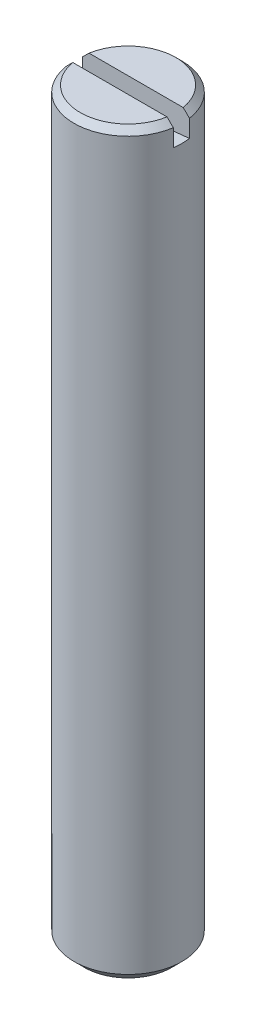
ISO-10303-21;
HEADER;
FILE_DESCRIPTION(('STEP AP214'),'2;1');
FILE_NAME('part.step','',(''),(''),'','','');
FILE_SCHEMA(('AUTOMOTIVE_DESIGN { 1 0 10303 214 1 1 1 1 }'));
ENDSEC;
DATA;
#1=APPLICATION_CONTEXT('core data for automotive mechanical design processes');
#2=APPLICATION_PROTOCOL_DEFINITION('international standard','automotive_design',2000,#1);
#3=PRODUCT_CONTEXT('',#1,'mechanical');
#4=PRODUCT('Part','Part','',(#3));
#5=PRODUCT_RELATED_PRODUCT_CATEGORY('part','',(#4));
#6=PRODUCT_DEFINITION_FORMATION('','',#4);
#7=PRODUCT_DEFINITION_CONTEXT('part definition',#1,'design');
#8=PRODUCT_DEFINITION('design','',#6,#7);
#9=PRODUCT_DEFINITION_SHAPE('','',#8);
#10=(LENGTH_UNIT() NAMED_UNIT(*) SI_UNIT(.MILLI.,.METRE.));
#11=(NAMED_UNIT(*) PLANE_ANGLE_UNIT() SI_UNIT($,.RADIAN.));
#12=(NAMED_UNIT(*) SI_UNIT($,.STERADIAN.) SOLID_ANGLE_UNIT());
#13=UNCERTAINTY_MEASURE_WITH_UNIT(LENGTH_MEASURE(1.E-05),#10,'distance_accuracy_value','');
#14=(GEOMETRIC_REPRESENTATION_CONTEXT(3) GLOBAL_UNCERTAINTY_ASSIGNED_CONTEXT((#13)) GLOBAL_UNIT_ASSIGNED_CONTEXT((#10,
#11,#12)) REPRESENTATION_CONTEXT('',''));
#15=CARTESIAN_POINT('',(0.,0.,0.));
#16=DIRECTION('',(0.,0.,1.));
#17=DIRECTION('',(1.,0.,0.));
#18=AXIS2_PLACEMENT_3D('',#15,#16,#17);
#19=CARTESIAN_POINT('',(0.,50.,0.));
#20=DIRECTION('',(0.,-1.,0.));
#21=DIRECTION('',(0.,0.,-1.));
#22=AXIS2_PLACEMENT_3D('',#19,#20,#21);
#23=PLANE('',#22);
#24=CARTESIAN_POINT('',(0.,50.0000000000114,0.));
#25=DIRECTION('',(0.,-1.,0.));
#26=DIRECTION('',(0.,0.,-1.));
#27=AXIS2_PLACEMENT_3D('',#24,#25,#26);
#28=CIRCLE('',#27,3.53999999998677);
#29=CARTESIAN_POINT('',(-3.48878202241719,50.0000000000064,-0.6));
#30=VERTEX_POINT('',#29);
#31=CARTESIAN_POINT('',(3.48878202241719,50.0000000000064,-0.6));
#32=VERTEX_POINT('',#31);
#33=EDGE_CURVE('E87',#30,#32,#28,.T.);
#34=ORIENTED_EDGE('',*,*,#33,.F.);
#35=DIRECTION('',(1.,0.,0.));
#36=VECTOR('',#35,1.);
#37=CARTESIAN_POINT('',(0.,50.,-0.6));
#38=LINE('',#37,#36);
#39=EDGE_CURVE('E19',#32,#30,#38,.F.);
#40=ORIENTED_EDGE('',*,*,#39,.F.);
#41=EDGE_LOOP('',(#34,#40));
#42=FACE_BOUND('',#41,.T.);
#43=ADVANCED_FACE('F14',(#42),#23,.F.);
#44=CARTESIAN_POINT('',(0.,50.,0.));
#45=DIRECTION('',(0.,-1.,0.));
#46=DIRECTION('',(0.,0.,-1.));
#47=AXIS2_PLACEMENT_3D('',#44,#45,#46);
#48=PLANE('',#47);
#49=DIRECTION('',(1.,0.,0.));
#50=VECTOR('',#49,1.);
#51=CARTESIAN_POINT('',(0.,50.,0.6));
#52=LINE('',#51,#50);
#53=CARTESIAN_POINT('',(-3.48878202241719,50.0000000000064,0.6));
#54=VERTEX_POINT('',#53);
#55=CARTESIAN_POINT('',(3.48878202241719,50.0000000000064,0.6));
#56=VERTEX_POINT('',#55);
#57=EDGE_CURVE('E81',#54,#56,#52,.T.);
#58=ORIENTED_EDGE('',*,*,#57,.F.);
#59=CARTESIAN_POINT('',(0.,50.0000000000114,0.));
#60=DIRECTION('',(0.,-1.,0.));
#61=DIRECTION('',(0.,0.,-1.));
#62=AXIS2_PLACEMENT_3D('',#59,#60,#61);
#63=CIRCLE('',#62,3.53999999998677);
#64=EDGE_CURVE('E74',#56,#54,#63,.T.);
#65=ORIENTED_EDGE('',*,*,#64,.F.);
#66=EDGE_LOOP('',(#58,#65));
#67=FACE_BOUND('',#66,.T.);
#68=ADVANCED_FACE('F86',(#67),#48,.F.);
#69=CARTESIAN_POINT('',(0.,49.5399999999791,0.));
#70=DIRECTION('',(0.,-1.,0.));
#71=DIRECTION('',(0.,0.,-1.));
#72=AXIS2_PLACEMENT_3D('',#69,#70,#71);
#73=CONICAL_SURFACE('',#72,3.99999999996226,0.785398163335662);
#74=CARTESIAN_POINT('',(-3.48878202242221,50.0000000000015,-0.6));
#75=CARTESIAN_POINT('',(-3.56650335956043,49.9233951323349,-0.6));
#76=CARTESIAN_POINT('',(-3.64419419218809,49.8467593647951,-0.6));
#77=CARTESIAN_POINT('',(-3.79951484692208,49.6934260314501,-0.6));
#78=CARTESIAN_POINT('',(-3.87714466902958,49.6167284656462,-0.6));
#79=CARTESIAN_POINT('',(-3.9547439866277,49.5399999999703,-0.6));
#80=B_SPLINE_CURVE_WITH_KNOTS('',3,(#74,#75,#76,#77,#78,#79),.UNSPECIFIED.,.F.,.F.,(4,2,4),(0.,
0.327383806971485,0.654767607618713),.UNSPECIFIED.);
#81=CARTESIAN_POINT('',(-3.95474398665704,49.5399999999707,-0.6));
#82=VERTEX_POINT('',#81);
#83=EDGE_CURVE('E85',#30,#82,#80,.T.);
#84=ORIENTED_EDGE('',*,*,#83,.F.);
#85=ORIENTED_EDGE('',*,*,#33,.T.);
#86=CARTESIAN_POINT('',(3.95474398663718,49.5399999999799,-0.600000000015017));
#87=CARTESIAN_POINT('',(3.87714466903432,49.616728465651,-0.600000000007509));
#88=CARTESIAN_POINT('',(3.79951484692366,49.6934260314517,-0.600000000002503));
#89=CARTESIAN_POINT('',(3.64419419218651,49.8467593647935,-0.599999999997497));
#90=CARTESIAN_POINT('',(3.56650335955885,49.9233951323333,-0.599999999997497));
#91=CARTESIAN_POINT('',(3.48878202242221,50.0000000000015,-0.6));
#92=B_SPLINE_CURVE_WITH_KNOTS('',3,(#86,#87,#88,#89,#90,#91),.UNSPECIFIED.,.F.,.F.,(4,2,4),(0.,
0.327383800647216,0.654767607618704),.UNSPECIFIED.);
#93=CARTESIAN_POINT('',(3.95474398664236,49.5399999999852,-0.6));
#94=VERTEX_POINT('',#93);
#95=EDGE_CURVE('E112',#94,#32,#92,.T.);
#96=ORIENTED_EDGE('',*,*,#95,.F.);
#97=CARTESIAN_POINT('',(0.,49.54,0.));
#98=DIRECTION('',(0.,-1.,0.));
#99=DIRECTION('',(0.,0.,-1.));
#100=AXIS2_PLACEMENT_3D('',#97,#98,#99);
#101=CIRCLE('',#100,4.);
#102=EDGE_CURVE('E101',#82,#94,#101,.T.);
#103=ORIENTED_EDGE('',*,*,#102,.F.);
#104=EDGE_LOOP('',(#84,#85,#96,#103));
#105=FACE_BOUND('',#104,.T.);
#106=ADVANCED_FACE('F128',(#105),#73,.T.);
#107=CARTESIAN_POINT('',(0.,79.5,-0.6));
#108=DIRECTION('',(0.,0.,1.));
#109=DIRECTION('',(1.,0.,0.));
#110=AXIS2_PLACEMENT_3D('',#107,#108,#109);
#111=PLANE('',#110);
#112=ORIENTED_EDGE('',*,*,#39,.T.);
#113=ORIENTED_EDGE('',*,*,#83,.T.);
#114=DIRECTION('',(0.,1.,0.));
#115=VECTOR('',#114,1.);
#116=CARTESIAN_POINT('',(-3.95474398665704,79.5,-0.6));
#117=LINE('',#116,#115);
#118=CARTESIAN_POINT('',(-3.95474398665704,48.2492400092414,-0.6));
#119=VERTEX_POINT('',#118);
#120=EDGE_CURVE('E58',#82,#119,#117,.F.);
#121=ORIENTED_EDGE('',*,*,#120,.T.);
#122=CARTESIAN_POINT('',(0.,79.5,-0.6));
#123=DIRECTION('',(0.,0.,-1.));
#124=DIRECTION('',(-1.,0.,0.));
#125=AXIS2_PLACEMENT_3D('',#122,#123,#124);
#126=CIRCLE('',#125,31.5);
#127=CARTESIAN_POINT('',(3.95474398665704,48.2492400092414,-0.6));
#128=VERTEX_POINT('',#127);
#129=EDGE_CURVE('E109',#119,#128,#126,.F.);
#130=ORIENTED_EDGE('',*,*,#129,.T.);
#131=DIRECTION('',(0.,1.,0.));
#132=VECTOR('',#131,1.);
#133=CARTESIAN_POINT('',(3.95474398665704,79.5,-0.6));
#134=LINE('',#133,#132);
#135=EDGE_CURVE('E110',#128,#94,#134,.T.);
#136=ORIENTED_EDGE('',*,*,#135,.T.);
#137=ORIENTED_EDGE('',*,*,#95,.T.);
#138=EDGE_LOOP('',(#112,#113,#121,#130,#136,#137));
#139=FACE_BOUND('',#138,.T.);
#140=ADVANCED_FACE('F124',(#139),#111,.T.);
#141=CARTESIAN_POINT('',(0.,49.5399999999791,0.));
#142=DIRECTION('',(0.,-1.,0.));
#143=DIRECTION('',(0.,0.,-1.));
#144=AXIS2_PLACEMENT_3D('',#141,#142,#143);
#145=CONICAL_SURFACE('',#144,3.99999999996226,0.785398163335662);
#146=ORIENTED_EDGE('',*,*,#64,.T.);
#147=CARTESIAN_POINT('',(-3.48878202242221,50.0000000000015,0.6));
#148=CARTESIAN_POINT('',(-3.56650335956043,49.9233951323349,0.6));
#149=CARTESIAN_POINT('',(-3.64419419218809,49.8467593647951,0.6));
#150=CARTESIAN_POINT('',(-3.79951484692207,49.6934260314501,0.6));
#151=CARTESIAN_POINT('',(-3.87714466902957,49.6167284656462,0.6));
#152=CARTESIAN_POINT('',(-3.95474398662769,49.5399999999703,0.6));
#153=B_SPLINE_CURVE_WITH_KNOTS('',3,(#147,#148,#149,#150,#151,#152),.UNSPECIFIED.,.F.,.F.,(4,2,
4),(0.,0.327383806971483,0.654767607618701),.UNSPECIFIED.);
#154=CARTESIAN_POINT('',(-3.95474398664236,49.5399999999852,0.6));
#155=VERTEX_POINT('',#154);
#156=EDGE_CURVE('E34',#54,#155,#153,.T.);
#157=ORIENTED_EDGE('',*,*,#156,.T.);
#158=CARTESIAN_POINT('',(0.,49.54,0.));
#159=DIRECTION('',(0.,-1.,0.));
#160=DIRECTION('',(0.,0.,-1.));
#161=AXIS2_PLACEMENT_3D('',#158,#159,#160);
#162=CIRCLE('',#161,4.);
#163=CARTESIAN_POINT('',(3.95474398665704,49.5399999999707,0.6));
#164=VERTEX_POINT('',#163);
#165=EDGE_CURVE('E75',#164,#155,#162,.T.);
#166=ORIENTED_EDGE('',*,*,#165,.F.);
#167=CARTESIAN_POINT('',(3.95474398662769,49.5399999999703,0.6));
#168=CARTESIAN_POINT('',(3.87714466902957,49.6167284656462,0.6));
#169=CARTESIAN_POINT('',(3.79951484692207,49.6934260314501,0.6));
#170=CARTESIAN_POINT('',(3.64419419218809,49.8467593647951,0.6));
#171=CARTESIAN_POINT('',(3.56650335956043,49.9233951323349,0.6));
#172=CARTESIAN_POINT('',(3.48878202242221,50.0000000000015,0.6));
#173=B_SPLINE_CURVE_WITH_KNOTS('',3,(#167,#168,#169,#170,#171,#172),.UNSPECIFIED.,.F.,.F.,(4,2,
4),(0.,0.327383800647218,0.654767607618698),.UNSPECIFIED.);
#174=EDGE_CURVE('E70',#164,#56,#173,.T.);
#175=ORIENTED_EDGE('',*,*,#174,.T.);
#176=EDGE_LOOP('',(#146,#157,#166,#175));
#177=FACE_BOUND('',#176,.T.);
#178=ADVANCED_FACE('F72',(#177),#145,.T.);
#179=CARTESIAN_POINT('',(0.,79.5,0.6));
#180=DIRECTION('',(0.,0.,1.));
#181=DIRECTION('',(1.,0.,0.));
#182=AXIS2_PLACEMENT_3D('',#179,#180,#181);
#183=PLANE('',#182);
#184=ORIENTED_EDGE('',*,*,#57,.T.);
#185=ORIENTED_EDGE('',*,*,#174,.F.);
#186=DIRECTION('',(0.,1.,0.));
#187=VECTOR('',#186,1.);
#188=CARTESIAN_POINT('',(3.95474398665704,79.5,0.6));
#189=LINE('',#188,#187);
#190=CARTESIAN_POINT('',(3.95474398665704,48.2492400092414,0.6));
#191=VERTEX_POINT('',#190);
#192=EDGE_CURVE('E78',#191,#164,#189,.T.);
#193=ORIENTED_EDGE('',*,*,#192,.F.);
#194=CARTESIAN_POINT('',(0.,79.5,0.6));
#195=DIRECTION('',(0.,0.,-1.));
#196=DIRECTION('',(-1.,0.,0.));
#197=AXIS2_PLACEMENT_3D('',#194,#195,#196);
#198=CIRCLE('',#197,31.5);
#199=CARTESIAN_POINT('',(-3.95474398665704,48.2492400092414,0.6));
#200=VERTEX_POINT('',#199);
#201=EDGE_CURVE('E106',#200,#191,#198,.F.);
#202=ORIENTED_EDGE('',*,*,#201,.F.);
#203=DIRECTION('',(0.,1.,0.));
#204=VECTOR('',#203,1.);
#205=CARTESIAN_POINT('',(-3.95474398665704,79.5,0.6));
#206=LINE('',#205,#204);
#207=EDGE_CURVE('E104',#155,#200,#206,.F.);
#208=ORIENTED_EDGE('',*,*,#207,.F.);
#209=ORIENTED_EDGE('',*,*,#156,.F.);
#210=EDGE_LOOP('',(#184,#185,#193,#202,#208,#209));
#211=FACE_BOUND('',#210,.T.);
#212=ADVANCED_FACE('F82',(#211),#183,.F.);
#213=CARTESIAN_POINT('',(0.,79.5,0.6));
#214=DIRECTION('',(0.,0.,-1.));
#215=DIRECTION('',(-1.,0.,0.));
#216=AXIS2_PLACEMENT_3D('',#213,#214,#215);
#217=CYLINDRICAL_SURFACE('',#216,31.5);
#218=CARTESIAN_POINT('',(3.95474398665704,48.2492400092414,-0.6));
#219=CARTESIAN_POINT('',(3.96984984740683,48.2511544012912,-0.500484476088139));
#220=CARTESIAN_POINT('',(3.98118553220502,48.2525972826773,-0.40038868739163));
#221=CARTESIAN_POINT('',(3.9962389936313,48.2545175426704,-0.20019306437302));
#222=CARTESIAN_POINT('',(4.,48.2550004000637,-0.10009653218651));
#223=CARTESIAN_POINT('',(4.,48.2550004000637,0.10009653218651));
#224=CARTESIAN_POINT('',(3.9962389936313,48.2545175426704,0.20019306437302));
#225=CARTESIAN_POINT('',(3.98118553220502,48.2525972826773,0.40038868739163));
#226=CARTESIAN_POINT('',(3.96984984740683,48.2511544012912,0.500484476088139));
#227=CARTESIAN_POINT('',(3.95474398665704,48.2492400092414,0.6));
#228=B_SPLINE_CURVE_WITH_KNOTS('',3,(#218,#219,#220,#221,#222,#223,#224,#225,#226,#227),
.UNSPECIFIED.,.F.,.F.,(4,2,2,2,4),(0.,0.301946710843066,0.602165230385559,0.902383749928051,
1.20433046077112),.UNSPECIFIED.);
#229=EDGE_CURVE('E25',#128,#191,#228,.T.);
#230=ORIENTED_EDGE('',*,*,#229,.F.);
#231=ORIENTED_EDGE('',*,*,#129,.F.);
#232=CARTESIAN_POINT('',(-3.95474398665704,48.2492400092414,0.6));
#233=CARTESIAN_POINT('',(-3.96984984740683,48.2511544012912,0.500484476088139));
#234=CARTESIAN_POINT('',(-3.98118553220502,48.2525972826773,0.40038868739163));
#235=CARTESIAN_POINT('',(-3.9962389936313,48.2545175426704,0.20019306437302));
#236=CARTESIAN_POINT('',(-4.,48.2550004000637,0.10009653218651));
#237=CARTESIAN_POINT('',(-4.,48.2550004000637,-0.10009653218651));
#238=CARTESIAN_POINT('',(-3.9962389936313,48.2545175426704,-0.20019306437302));
#239=CARTESIAN_POINT('',(-3.98118553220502,48.2525972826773,-0.40038868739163));
#240=CARTESIAN_POINT('',(-3.96984984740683,48.2511544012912,-0.500484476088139));
#241=CARTESIAN_POINT('',(-3.95474398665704,48.2492400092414,-0.6));
#242=B_SPLINE_CURVE_WITH_KNOTS('',3,(#232,#233,#234,#235,#236,#237,#238,#239,#240,#241),
.UNSPECIFIED.,.F.,.F.,(4,2,2,2,4),(0.,0.301946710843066,0.602165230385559,0.902383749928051,
1.20433046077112),.UNSPECIFIED.);
#243=EDGE_CURVE('E9',#200,#119,#242,.T.);
#244=ORIENTED_EDGE('',*,*,#243,.F.);
#245=ORIENTED_EDGE('',*,*,#201,.T.);
#246=EDGE_LOOP('',(#230,#231,#244,#245));
#247=FACE_BOUND('',#246,.T.);
#248=ADVANCED_FACE('F151',(#247),#217,.F.);
#249=CARTESIAN_POINT('',(0.,37.5,0.));
#250=DIRECTION('',(0.,-1.,0.));
#251=DIRECTION('',(0.,0.,-1.));
#252=AXIS2_PLACEMENT_3D('',#249,#250,#251);
#253=CYLINDRICAL_SURFACE('',#252,4.);
#254=ORIENTED_EDGE('',*,*,#229,.T.);
#255=ORIENTED_EDGE('',*,*,#192,.T.);
#256=ORIENTED_EDGE('',*,*,#165,.T.);
#257=ORIENTED_EDGE('',*,*,#207,.T.);
#258=ORIENTED_EDGE('',*,*,#243,.T.);
#259=ORIENTED_EDGE('',*,*,#120,.F.);
#260=ORIENTED_EDGE('',*,*,#102,.T.);
#261=ORIENTED_EDGE('',*,*,#135,.F.);
#262=EDGE_LOOP('',(#254,#255,#256,#257,#258,#259,#260,#261));
#263=FACE_BOUND('',#262,.T.);
#264=CARTESIAN_POINT('',(0.,-4.233,0.));
#265=DIRECTION('',(0.,-1.,0.));
#266=DIRECTION('',(0.,0.,-1.));
#267=AXIS2_PLACEMENT_3D('',#264,#265,#266);
#268=CIRCLE('',#267,4.);
#269=CARTESIAN_POINT('',(0.,-4.233,-4.));
#270=VERTEX_POINT('',#269);
#271=EDGE_CURVE('E103',#270,#270,#268,.T.);
#272=ORIENTED_EDGE('',*,*,#271,.F.);
#273=EDGE_LOOP('',(#272));
#274=FACE_BOUND('',#273,.T.);
#275=ADVANCED_FACE('F16',(#263,#274),#253,.T.);
#276=CARTESIAN_POINT('',(3.233,-5.,0.));
#277=DIRECTION('',(0.,1.,0.));
#278=DIRECTION('',(0.,0.,1.));
#279=AXIS2_PLACEMENT_3D('',#276,#277,#278);
#280=PLANE('',#279);
#281=CARTESIAN_POINT('',(0.,-5.,0.));
#282=DIRECTION('',(0.,1.,0.));
#283=DIRECTION('',(-1.,0.,0.));
#284=AXIS2_PLACEMENT_3D('',#281,#282,#283);
#285=CIRCLE('',#284,3.23299999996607);
#286=CARTESIAN_POINT('',(-3.23299999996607,-5.,0.));
#287=VERTEX_POINT('',#286);
#288=EDGE_CURVE('E171',#287,#287,#285,.T.);
#289=ORIENTED_EDGE('',*,*,#288,.F.);
#290=EDGE_LOOP('',(#289));
#291=FACE_BOUND('',#290,.T.);
#292=ADVANCED_FACE('F157',(#291),#280,.F.);
#293=CARTESIAN_POINT('',(0.,-4.23299999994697,0.));
#294=DIRECTION('',(0.,1.,0.));
#295=DIRECTION('',(-1.,0.,0.));
#296=AXIS2_PLACEMENT_3D('',#293,#294,#295);
#297=CONICAL_SURFACE('',#296,4.0000000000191,0.785398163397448);
#298=ORIENTED_EDGE('',*,*,#271,.T.);
#299=EDGE_LOOP('',(#298));
#300=FACE_BOUND('',#299,.T.);
#301=ORIENTED_EDGE('',*,*,#288,.T.);
#302=EDGE_LOOP('',(#301));
#303=FACE_BOUND('',#302,.T.);
#304=ADVANCED_FACE('F177',(#300,#303),#297,.T.);
#305=CLOSED_SHELL('',(#43,#68,#106,#140,#178,#212,#248,#275,#292,#304));
#306=MANIFOLD_SOLID_BREP('B1',#305);
#307=ADVANCED_BREP_SHAPE_REPRESENTATION('',(#18,#306),#14);
#308=SHAPE_DEFINITION_REPRESENTATION(#9,#307);
ENDSEC;
END-ISO-10303-21;
